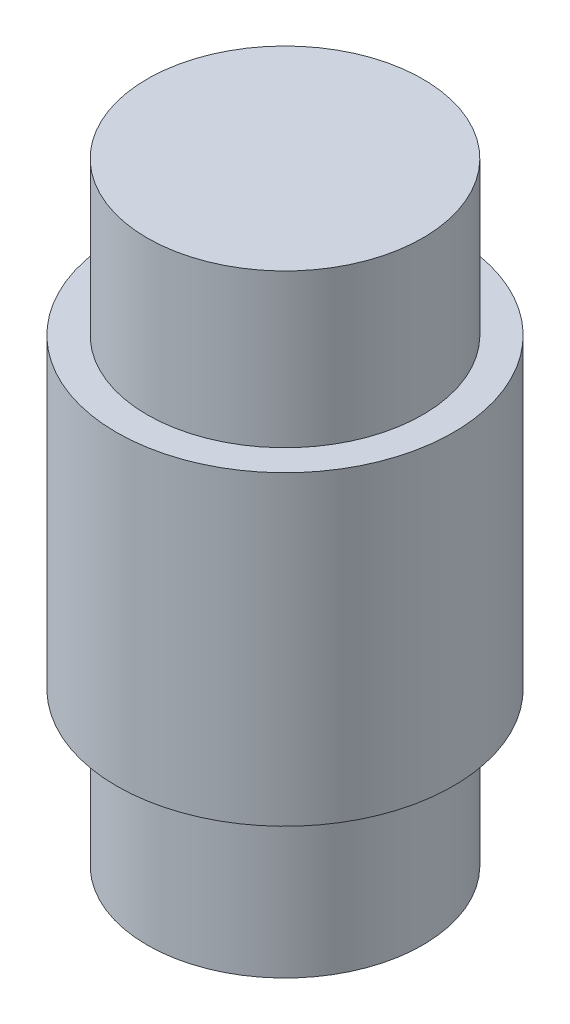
ISO-10303-21;
HEADER;
FILE_DESCRIPTION(('STEP AP214'),'2;1');
FILE_NAME('part.step','',(''),(''),'','','');
FILE_SCHEMA(('AUTOMOTIVE_DESIGN { 1 0 10303 214 1 1 1 1 }'));
ENDSEC;
DATA;
#1=APPLICATION_CONTEXT('core data for automotive mechanical design processes');
#2=APPLICATION_PROTOCOL_DEFINITION('international standard','automotive_design',2000,#1);
#3=PRODUCT_CONTEXT('',#1,'mechanical');
#4=PRODUCT('Part','Part','',(#3));
#5=PRODUCT_RELATED_PRODUCT_CATEGORY('part','',(#4));
#6=PRODUCT_DEFINITION_FORMATION('','',#4);
#7=PRODUCT_DEFINITION_CONTEXT('part definition',#1,'design');
#8=PRODUCT_DEFINITION('design','',#6,#7);
#9=PRODUCT_DEFINITION_SHAPE('','',#8);
#10=(LENGTH_UNIT() NAMED_UNIT(*) SI_UNIT(.MILLI.,.METRE.));
#11=(NAMED_UNIT(*) PLANE_ANGLE_UNIT() SI_UNIT($,.RADIAN.));
#12=(NAMED_UNIT(*) SI_UNIT($,.STERADIAN.) SOLID_ANGLE_UNIT());
#13=UNCERTAINTY_MEASURE_WITH_UNIT(LENGTH_MEASURE(1.E-05),#10,'distance_accuracy_value','');
#14=(GEOMETRIC_REPRESENTATION_CONTEXT(3) GLOBAL_UNCERTAINTY_ASSIGNED_CONTEXT((#13)) GLOBAL_UNIT_ASSIGNED_CONTEXT((#10,
#11,#12)) REPRESENTATION_CONTEXT('',''));
#15=CARTESIAN_POINT('',(0.,0.,0.));
#16=DIRECTION('',(0.,0.,1.));
#17=DIRECTION('',(1.,0.,0.));
#18=AXIS2_PLACEMENT_3D('',#15,#16,#17);
#19=CARTESIAN_POINT('',(0.,19.05,0.));
#20=DIRECTION('',(0.,1.,0.));
#21=DIRECTION('',(0.,0.,1.));
#22=AXIS2_PLACEMENT_3D('',#19,#20,#21);
#23=PLANE('',#22);
#24=CARTESIAN_POINT('',(0.,19.05,0.));
#25=DIRECTION('',(0.,1.,0.));
#26=DIRECTION('',(0.,0.,1.));
#27=AXIS2_PLACEMENT_3D('',#24,#25,#26);
#28=CIRCLE('',#27,6.985);
#29=CARTESIAN_POINT('',(0.,19.05,6.985));
#30=VERTEX_POINT('',#29);
#31=EDGE_CURVE('E41',#30,#30,#28,.T.);
#32=ORIENTED_EDGE('',*,*,#31,.T.);
#33=EDGE_LOOP('',(#32));
#34=FACE_BOUND('',#33,.T.);
#35=CARTESIAN_POINT('',(0.,19.05,0.));
#36=DIRECTION('',(0.,1.,0.));
#37=DIRECTION('',(0.,0.,1.));
#38=AXIS2_PLACEMENT_3D('',#35,#36,#37);
#39=CIRCLE('',#38,5.715);
#40=CARTESIAN_POINT('',(0.,19.05,5.715));
#41=VERTEX_POINT('',#40);
#42=EDGE_CURVE('E49',#41,#41,#39,.T.);
#43=ORIENTED_EDGE('',*,*,#42,.F.);
#44=EDGE_LOOP('',(#43));
#45=FACE_BOUND('',#44,.T.);
#46=ADVANCED_FACE('F30',(#34,#45),#23,.T.);
#47=CARTESIAN_POINT('',(0.,6.35,0.));
#48=DIRECTION('',(0.,-1.,0.));
#49=DIRECTION('',(0.,0.,-1.));
#50=AXIS2_PLACEMENT_3D('',#47,#48,#49);
#51=CYLINDRICAL_SURFACE('',#50,5.715);
#52=CARTESIAN_POINT('',(0.,6.35,0.));
#53=DIRECTION('',(0.,1.,0.));
#54=DIRECTION('',(0.,0.,1.));
#55=AXIS2_PLACEMENT_3D('',#52,#53,#54);
#56=CIRCLE('',#55,5.715);
#57=CARTESIAN_POINT('',(0.,6.35,5.715));
#58=VERTEX_POINT('',#57);
#59=EDGE_CURVE('E10',#58,#58,#56,.T.);
#60=ORIENTED_EDGE('',*,*,#59,.F.);
#61=EDGE_LOOP('',(#60));
#62=FACE_BOUND('',#61,.T.);
#63=CARTESIAN_POINT('',(0.,0.,0.));
#64=DIRECTION('',(0.,1.,0.));
#65=DIRECTION('',(0.,0.,1.));
#66=AXIS2_PLACEMENT_3D('',#63,#64,#65);
#67=CIRCLE('',#66,5.715);
#68=CARTESIAN_POINT('',(0.,0.,5.715));
#69=VERTEX_POINT('',#68);
#70=EDGE_CURVE('E34',#69,#69,#67,.T.);
#71=ORIENTED_EDGE('',*,*,#70,.T.);
#72=EDGE_LOOP('',(#71));
#73=FACE_BOUND('',#72,.T.);
#74=ADVANCED_FACE('F32',(#62,#73),#51,.T.);
#75=CARTESIAN_POINT('',(0.,0.,0.));
#76=DIRECTION('',(0.,1.,0.));
#77=DIRECTION('',(0.,0.,1.));
#78=AXIS2_PLACEMENT_3D('',#75,#76,#77);
#79=PLANE('',#78);
#80=ORIENTED_EDGE('',*,*,#70,.F.);
#81=EDGE_LOOP('',(#80));
#82=FACE_BOUND('',#81,.T.);
#83=ADVANCED_FACE('F70',(#82),#79,.F.);
#84=CARTESIAN_POINT('',(0.,6.35,0.));
#85=DIRECTION('',(0.,1.,0.));
#86=DIRECTION('',(0.,0.,1.));
#87=AXIS2_PLACEMENT_3D('',#84,#85,#86);
#88=PLANE('',#87);
#89=CARTESIAN_POINT('',(0.,6.35,0.));
#90=DIRECTION('',(0.,1.,0.));
#91=DIRECTION('',(0.,0.,1.));
#92=AXIS2_PLACEMENT_3D('',#89,#90,#91);
#93=CIRCLE('',#92,6.985);
#94=CARTESIAN_POINT('',(0.,6.35,6.985));
#95=VERTEX_POINT('',#94);
#96=EDGE_CURVE('E43',#95,#95,#93,.T.);
#97=ORIENTED_EDGE('',*,*,#96,.F.);
#98=EDGE_LOOP('',(#97));
#99=FACE_BOUND('',#98,.T.);
#100=ORIENTED_EDGE('',*,*,#59,.T.);
#101=EDGE_LOOP('',(#100));
#102=FACE_BOUND('',#101,.T.);
#103=ADVANCED_FACE('F74',(#99,#102),#88,.F.);
#104=CARTESIAN_POINT('',(0.,19.05,0.));
#105=DIRECTION('',(0.,-1.,0.));
#106=DIRECTION('',(0.,0.,-1.));
#107=AXIS2_PLACEMENT_3D('',#104,#105,#106);
#108=CYLINDRICAL_SURFACE('',#107,6.985);
#109=ORIENTED_EDGE('',*,*,#31,.F.);
#110=EDGE_LOOP('',(#109));
#111=FACE_BOUND('',#110,.T.);
#112=ORIENTED_EDGE('',*,*,#96,.T.);
#113=EDGE_LOOP('',(#112));
#114=FACE_BOUND('',#113,.T.);
#115=ADVANCED_FACE('F60',(#111,#114),#108,.T.);
#116=CARTESIAN_POINT('',(0.,25.4,0.));
#117=DIRECTION('',(0.,-1.,0.));
#118=DIRECTION('',(0.,0.,-1.));
#119=AXIS2_PLACEMENT_3D('',#116,#117,#118);
#120=CYLINDRICAL_SURFACE('',#119,5.715);
#121=CARTESIAN_POINT('',(0.,25.4,0.));
#122=DIRECTION('',(0.,1.,0.));
#123=DIRECTION('',(0.,0.,1.));
#124=AXIS2_PLACEMENT_3D('',#121,#122,#123);
#125=CIRCLE('',#124,5.715);
#126=CARTESIAN_POINT('',(0.,25.4,5.715));
#127=VERTEX_POINT('',#126);
#128=EDGE_CURVE('E46',#127,#127,#125,.T.);
#129=ORIENTED_EDGE('',*,*,#128,.F.);
#130=EDGE_LOOP('',(#129));
#131=FACE_BOUND('',#130,.T.);
#132=ORIENTED_EDGE('',*,*,#42,.T.);
#133=EDGE_LOOP('',(#132));
#134=FACE_BOUND('',#133,.T.);
#135=ADVANCED_FACE('F57',(#131,#134),#120,.T.);
#136=CARTESIAN_POINT('',(0.,25.4,0.));
#137=DIRECTION('',(0.,1.,0.));
#138=DIRECTION('',(0.,0.,1.));
#139=AXIS2_PLACEMENT_3D('',#136,#137,#138);
#140=PLANE('',#139);
#141=ORIENTED_EDGE('',*,*,#128,.T.);
#142=EDGE_LOOP('',(#141));
#143=FACE_BOUND('',#142,.T.);
#144=ADVANCED_FACE('F55',(#143),#140,.T.);
#145=CLOSED_SHELL('',(#46,#74,#83,#103,#115,#135,#144));
#146=MANIFOLD_SOLID_BREP('B2',#145);
#147=ADVANCED_BREP_SHAPE_REPRESENTATION('',(#18,#146),#14);
#148=SHAPE_DEFINITION_REPRESENTATION(#9,#147);
ENDSEC;
END-ISO-10303-21;
